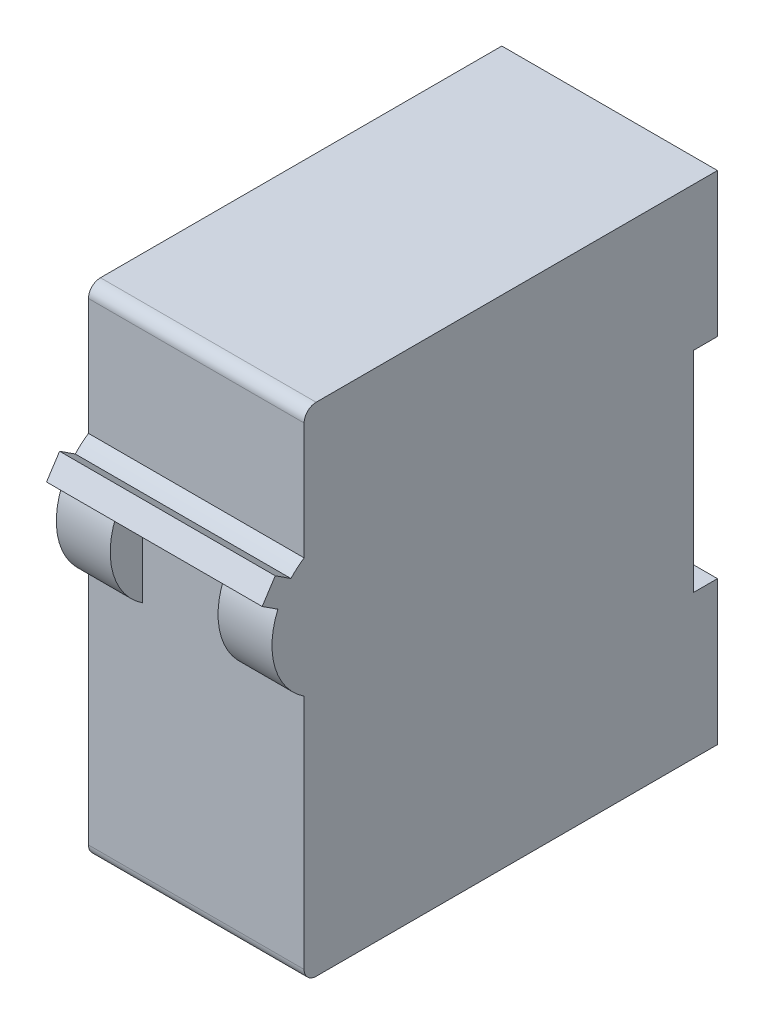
from build123d import *

# Parameters (mm, degrees)
EW_EXTRUDE_DEPTH = 36
CONG_1_R         = 2
ESQUISSE2_W      = 18
ESQUISSE2_H      = 14.766914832
EXTRUSION2_DEPTH = 114.780490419


with BuildPart() as part:
    # EW_SKETCH → EW_EXTRUDE (new body)
    with BuildSketch(Plane(origin=(0, 0, 0), x_dir=(0, 0, -1), z_dir=(1, 0, 0))):
        with BuildLine():
            Line((0, 83), (0, 59))
            Line((0, 59), (-4, 59))
            Line((-4, 59), (-4, 24))
            Line((-4, 24), (0, 24))
            Line((0, 24), (0, 0))
            Line((0, 0), (-69, 0))
            Line((-69, 0), (-69, 41.5))
            ThreePointArc((-69, 41.5), (-73.871493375, 48.088125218), (-73.379312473, 56.266914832))
            Line((-73.379312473, 56.266914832), (-76, 57.968809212))
            Line((-76, 57.968809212), (-73.82144386, 61.323491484))
            Line((-73.82144386, 61.323491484), (-71.200756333, 59.621597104))
            ThreePointArc((-71.200756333, 59.621597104), (-70.157199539, 60.627371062), (-69, 61.5))
            Line((-69, 61.5), (-69, 83))
            Line((-69, 83), (0, 83))
        make_face()
    extrude(amount=EW_EXTRUDE_DEPTH)

    # Cong_1
    cong_1_edges = [part.edges().sort_by_distance(p)[0] for p in [
        (18, 0, 69),
        (18, 83, 69),
    ]]
    fillet(cong_1_edges, radius=CONG_1_R)

    # Esquisse2 → Extrusion2 (cut, through all)
    with BuildSketch(Plane.XY.offset(69)):
        with Locations((18, 48.883457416)):
            Rectangle(ESQUISSE2_W, ESQUISSE2_H)
    extrude(amount=EXTRUSION2_DEPTH, mode=Mode.SUBTRACT)


solid = part.part
